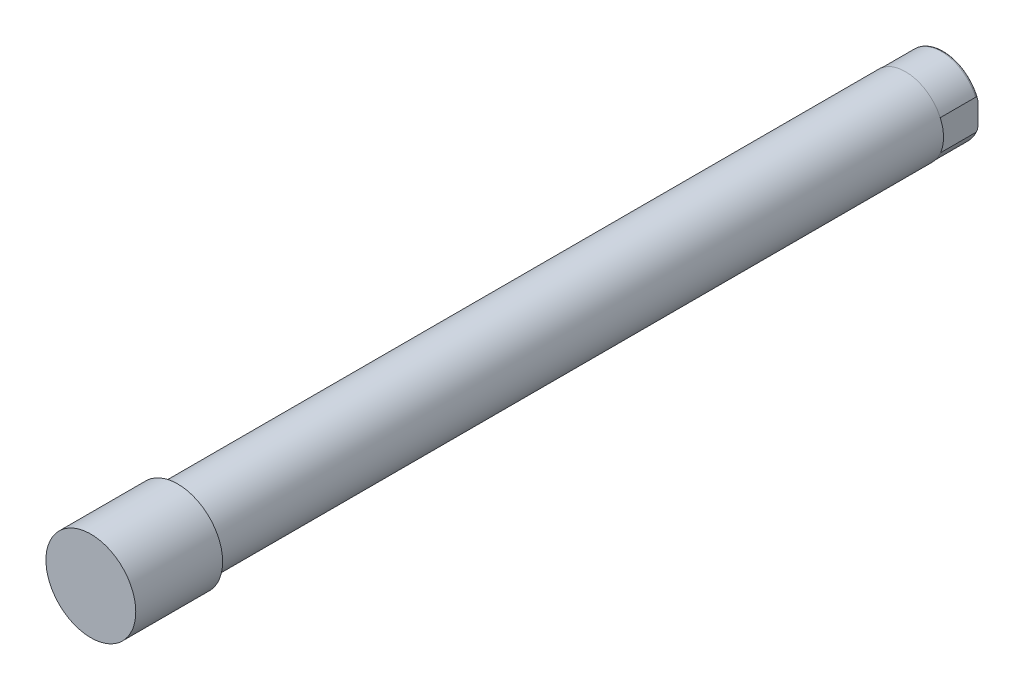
ISO-10303-21;
HEADER;
FILE_DESCRIPTION(('STEP AP214'),'2;1');
FILE_NAME('part.step','',(''),(''),'','','');
FILE_SCHEMA(('AUTOMOTIVE_DESIGN { 1 0 10303 214 1 1 1 1 }'));
ENDSEC;
DATA;
#1=APPLICATION_CONTEXT('core data for automotive mechanical design processes');
#2=APPLICATION_PROTOCOL_DEFINITION('international standard','automotive_design',2000,#1);
#3=PRODUCT_CONTEXT('',#1,'mechanical');
#4=PRODUCT('Part','Part','',(#3));
#5=PRODUCT_RELATED_PRODUCT_CATEGORY('part','',(#4));
#6=PRODUCT_DEFINITION_FORMATION('','',#4);
#7=PRODUCT_DEFINITION_CONTEXT('part definition',#1,'design');
#8=PRODUCT_DEFINITION('design','',#6,#7);
#9=PRODUCT_DEFINITION_SHAPE('','',#8);
#10=(LENGTH_UNIT() NAMED_UNIT(*) SI_UNIT(.MILLI.,.METRE.));
#11=(NAMED_UNIT(*) PLANE_ANGLE_UNIT() SI_UNIT($,.RADIAN.));
#12=(NAMED_UNIT(*) SI_UNIT($,.STERADIAN.) SOLID_ANGLE_UNIT());
#13=UNCERTAINTY_MEASURE_WITH_UNIT(LENGTH_MEASURE(1.E-05),#10,'distance_accuracy_value','');
#14=(GEOMETRIC_REPRESENTATION_CONTEXT(3) GLOBAL_UNCERTAINTY_ASSIGNED_CONTEXT((#13)) GLOBAL_UNIT_ASSIGNED_CONTEXT((#10,
#11,#12)) REPRESENTATION_CONTEXT('',''));
#15=CARTESIAN_POINT('',(0.,0.,0.));
#16=DIRECTION('',(0.,0.,1.));
#17=DIRECTION('',(1.,0.,0.));
#18=AXIS2_PLACEMENT_3D('',#15,#16,#17);
#19=CARTESIAN_POINT('',(0.,0.,255.2069863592));
#20=DIRECTION('',(0.,0.,1.));
#21=DIRECTION('',(-1.,0.,0.));
#22=AXIS2_PLACEMENT_3D('',#19,#20,#21);
#23=PLANE('',#22);
#24=CARTESIAN_POINT('',(0.,0.,255.2069863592));
#25=DIRECTION('',(0.,0.,1.));
#26=DIRECTION('',(0.,-1.,0.));
#27=AXIS2_PLACEMENT_3D('',#24,#25,#26);
#28=CIRCLE('',#27,12.573);
#29=CARTESIAN_POINT('',(0.,-12.573,255.2069863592));
#30=VERTEX_POINT('',#29);
#31=EDGE_CURVE('E10',#30,#30,#28,.T.);
#32=ORIENTED_EDGE('',*,*,#31,.F.);
#33=EDGE_LOOP('',(#32));
#34=FACE_BOUND('',#33,.T.);
#35=CARTESIAN_POINT('',(0.,0.,255.2069863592));
#36=DIRECTION('',(0.,0.,1.));
#37=DIRECTION('',(-1.,0.,0.));
#38=AXIS2_PLACEMENT_3D('',#35,#36,#37);
#39=CIRCLE('',#38,12.69238);
#40=CARTESIAN_POINT('',(-12.69238,0.,255.2069863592));
#41=VERTEX_POINT('',#40);
#42=EDGE_CURVE('E212',#41,#41,#39,.T.);
#43=ORIENTED_EDGE('',*,*,#42,.T.);
#44=EDGE_LOOP('',(#43));
#45=FACE_BOUND('',#44,.T.);
#46=ADVANCED_FACE('F16',(#34,#45),#23,.T.);
#47=CARTESIAN_POINT('',(0.,0.,229.8069863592));
#48=DIRECTION('',(0.,0.,1.));
#49=DIRECTION('',(-1.,0.,0.));
#50=AXIS2_PLACEMENT_3D('',#47,#48,#49);
#51=CYLINDRICAL_SURFACE('',#50,12.69238);
#52=ORIENTED_EDGE('',*,*,#42,.F.);
#53=EDGE_LOOP('',(#52));
#54=FACE_BOUND('',#53,.T.);
#55=CARTESIAN_POINT('',(0.,0.,12.7));
#56=DIRECTION('',(0.,0.,1.));
#57=DIRECTION('',(0.,1.,0.));
#58=AXIS2_PLACEMENT_3D('',#55,#56,#57);
#59=CIRCLE('',#58,12.69238);
#60=CARTESIAN_POINT('',(0.,12.69238,12.7));
#61=VERTEX_POINT('',#60);
#62=EDGE_CURVE('E80',#61,#61,#59,.T.);
#63=ORIENTED_EDGE('',*,*,#62,.T.);
#64=EDGE_LOOP('',(#63));
#65=FACE_BOUND('',#64,.T.);
#66=ADVANCED_FACE('F150',(#54,#65),#51,.T.);
#67=CARTESIAN_POINT('',(0.,0.,16.51));
#68=DIRECTION('',(0.,0.,-1.));
#69=DIRECTION('',(0.,-1.,0.));
#70=AXIS2_PLACEMENT_3D('',#67,#68,#69);
#71=PLANE('',#70);
#72=CARTESIAN_POINT('',(0.,0.,16.51));
#73=DIRECTION('',(0.,0.,-1.));
#74=DIRECTION('',(0.,-1.,0.));
#75=AXIS2_PLACEMENT_3D('',#72,#73,#74);
#76=CIRCLE('',#75,3.375);
#77=CARTESIAN_POINT('',(0.,-3.375,16.51));
#78=VERTEX_POINT('',#77);
#79=EDGE_CURVE('E209',#78,#78,#76,.T.);
#80=ORIENTED_EDGE('',*,*,#79,.T.);
#81=EDGE_LOOP('',(#80));
#82=FACE_BOUND('',#81,.T.);
#83=ADVANCED_FACE('F136',(#82),#71,.T.);
#84=CARTESIAN_POINT('',(0.,0.,-4.72421244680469));
#85=DIRECTION('',(0.,0.,-1.));
#86=DIRECTION('',(0.,-1.,0.));
#87=AXIS2_PLACEMENT_3D('',#84,#85,#86);
#88=CYLINDRICAL_SURFACE('',#87,3.375);
#89=ORIENTED_EDGE('',*,*,#79,.F.);
#90=EDGE_LOOP('',(#89));
#91=FACE_BOUND('',#90,.T.);
#92=CARTESIAN_POINT('',(0.,0.,0.635));
#93=DIRECTION('',(0.,0.,1.));
#94=DIRECTION('',(0.,1.,0.));
#95=AXIS2_PLACEMENT_3D('',#92,#93,#94);
#96=CIRCLE('',#95,3.375);
#97=CARTESIAN_POINT('',(0.,3.37500000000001,0.635000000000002));
#98=VERTEX_POINT('',#97);
#99=EDGE_CURVE('E198',#98,#98,#96,.F.);
#100=ORIENTED_EDGE('',*,*,#99,.T.);
#101=EDGE_LOOP('',(#100));
#102=FACE_BOUND('',#101,.T.);
#103=ADVANCED_FACE('F133',(#91,#102),#88,.F.);
#104=CARTESIAN_POINT('',(0.,0.,0.635));
#105=DIRECTION('',(0.,0.,-1.));
#106=DIRECTION('',(0.,-1.,0.));
#107=AXIS2_PLACEMENT_3D('',#104,#105,#106);
#108=CONICAL_SURFACE('',#107,3.375,0.785398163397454);
#109=CARTESIAN_POINT('',(0.,0.,0.));
#110=DIRECTION('',(0.,0.,1.));
#111=DIRECTION('',(0.,1.,0.));
#112=AXIS2_PLACEMENT_3D('',#109,#110,#111);
#113=CIRCLE('',#112,4.01);
#114=CARTESIAN_POINT('',(0.,4.01000000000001,0.));
#115=VERTEX_POINT('',#114);
#116=EDGE_CURVE('E20',#115,#115,#113,.T.);
#117=ORIENTED_EDGE('',*,*,#116,.F.);
#118=EDGE_LOOP('',(#117));
#119=FACE_BOUND('',#118,.T.);
#120=ORIENTED_EDGE('',*,*,#99,.F.);
#121=EDGE_LOOP('',(#120));
#122=FACE_BOUND('',#121,.T.);
#123=ADVANCED_FACE('F18',(#119,#122),#108,.F.);
#124=CARTESIAN_POINT('',(0.,3.375,0.));
#125=DIRECTION('',(0.,0.,1.));
#126=DIRECTION('',(0.,1.,0.));
#127=AXIS2_PLACEMENT_3D('',#124,#125,#126);
#128=PLANE('',#127);
#129=ORIENTED_EDGE('',*,*,#116,.T.);
#130=EDGE_LOOP('',(#129));
#131=FACE_BOUND('',#130,.T.);
#132=CARTESIAN_POINT('',(0.,0.,0.));
#133=DIRECTION('',(0.,0.,1.));
#134=DIRECTION('',(0.,1.,0.));
#135=AXIS2_PLACEMENT_3D('',#132,#133,#134);
#136=CIRCLE('',#135,11.811);
#137=CARTESIAN_POINT('',(11.4935,-2.72014314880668,0.));
#138=VERTEX_POINT('',#137);
#139=CARTESIAN_POINT('',(-11.4935,-2.72014314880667,0.));
#140=VERTEX_POINT('',#139);
#141=EDGE_CURVE('E104',#138,#140,#136,.F.);
#142=ORIENTED_EDGE('',*,*,#141,.T.);
#143=DIRECTION('',(0.,-1.,0.));
#144=VECTOR('',#143,1.);
#145=CARTESIAN_POINT('',(-11.4935,5.09703705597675,0.));
#146=LINE('',#145,#144);
#147=CARTESIAN_POINT('',(-11.4935,2.72014314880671,0.));
#148=VERTEX_POINT('',#147);
#149=EDGE_CURVE('E94',#148,#140,#146,.T.);
#150=ORIENTED_EDGE('',*,*,#149,.F.);
#151=CARTESIAN_POINT('',(11.4935,2.7201431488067,0.));
#152=VERTEX_POINT('',#151);
#153=EDGE_CURVE('E102',#148,#152,#136,.F.);
#154=ORIENTED_EDGE('',*,*,#153,.T.);
#155=DIRECTION('',(0.,1.,0.));
#156=VECTOR('',#155,1.);
#157=CARTESIAN_POINT('',(11.4935,5.09703705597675,0.));
#158=LINE('',#157,#156);
#159=EDGE_CURVE('E90',#138,#152,#158,.T.);
#160=ORIENTED_EDGE('',*,*,#159,.F.);
#161=EDGE_LOOP('',(#142,#150,#154,#160));
#162=FACE_BOUND('',#161,.T.);
#163=ADVANCED_FACE('F138',(#131,#162),#128,.F.);
#164=CARTESIAN_POINT('',(0.,0.,0.762));
#165=DIRECTION('',(0.,0.,1.));
#166=DIRECTION('',(0.,1.,0.));
#167=AXIS2_PLACEMENT_3D('',#164,#165,#166);
#168=TOROIDAL_SURFACE('',#167,11.811,0.762);
#169=CARTESIAN_POINT('',(-11.4935,0.,0.0692967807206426));
#170=CARTESIAN_POINT('',(-11.4935,-0.126892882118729,0.0692961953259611));
#171=CARTESIAN_POINT('',(-11.4935,-0.253785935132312,0.0683214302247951));
#172=CARTESIAN_POINT('',(-11.4935,-0.507552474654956,0.0645639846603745));
#173=CARTESIAN_POINT('',(-11.4935,-0.634425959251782,0.0617811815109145));
#174=CARTESIAN_POINT('',(-11.4935,-0.888441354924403,0.054807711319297));
#175=CARTESIAN_POINT('',(-11.4935,-1.01558316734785,0.0506136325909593));
#176=CARTESIAN_POINT('',(-11.4935,-1.26981683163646,0.0414520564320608));
#177=CARTESIAN_POINT('',(-11.4935,-1.39690868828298,0.0364846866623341));
#178=CARTESIAN_POINT('',(-11.4935,-1.72923810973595,0.0235085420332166));
#179=CARTESIAN_POINT('',(-11.4935,-1.93447479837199,0.0155077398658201));
#180=CARTESIAN_POINT('',(-11.4935,-2.3452927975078,0.00350629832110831));
#181=CARTESIAN_POINT('',(-11.4935,-2.55087425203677,-0.000490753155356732));
#182=CARTESIAN_POINT('',(-11.4935,-2.8589168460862,0.000314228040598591));
#183=CARTESIAN_POINT('',(-11.4935,-2.96137763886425,0.00170827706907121));
#184=CARTESIAN_POINT('',(-11.4935,-3.16620727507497,0.00754578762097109));
#185=CARTESIAN_POINT('',(-11.4935,-3.26857612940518,0.0119888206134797));
#186=CARTESIAN_POINT('',(-11.4935,-3.47289957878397,0.0248727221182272));
#187=CARTESIAN_POINT('',(-11.4935,-3.57485458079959,0.0333068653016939));
#188=CARTESIAN_POINT('',(-11.4935,-3.77818054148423,0.0554156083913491));
#189=CARTESIAN_POINT('',(-11.4935,-3.87955178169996,0.06908742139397));
#190=CARTESIAN_POINT('',(-11.4935,-4.03106259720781,0.0949374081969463));
#191=CARTESIAN_POINT('',(-11.4935,-4.08165102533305,0.10448729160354));
#192=CARTESIAN_POINT('',(-11.4935,-4.18240597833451,0.125703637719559));
#193=CARTESIAN_POINT('',(-11.4935,-4.23257236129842,0.137370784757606));
#194=CARTESIAN_POINT('',(-11.4935,-4.33209838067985,0.163182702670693));
#195=CARTESIAN_POINT('',(-11.4935,-4.38146010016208,0.177319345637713));
#196=CARTESIAN_POINT('',(-11.4935,-4.47919900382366,0.208628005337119));
#197=CARTESIAN_POINT('',(-11.4935,-4.52757673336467,0.225798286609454));
#198=CARTESIAN_POINT('',(-11.4935,-4.61806962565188,0.262016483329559));
#199=CARTESIAN_POINT('',(-11.4935,-4.66032699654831,0.280704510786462));
#200=CARTESIAN_POINT('',(-11.4935,-4.7431349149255,0.322012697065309));
#201=CARTESIAN_POINT('',(-11.4935,-4.78367806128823,0.344648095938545));
#202=CARTESIAN_POINT('',(-11.4935,-4.86229215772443,0.395289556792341));
#203=CARTESIAN_POINT('',(-11.4935,-4.90031004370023,0.423379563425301));
#204=CARTESIAN_POINT('',(-11.4935,-4.97037880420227,0.486182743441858));
#205=CARTESIAN_POINT('',(-11.4935,-5.00247662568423,0.520838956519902));
#206=CARTESIAN_POINT('',(-11.4935,-5.04022262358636,0.57571309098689));
#207=CARTESIAN_POINT('',(-11.4935,-5.05045795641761,0.592752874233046));
#208=CARTESIAN_POINT('',(-11.4935,-5.06829844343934,0.628176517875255));
#209=CARTESIAN_POINT('',(-11.4935,-5.07590504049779,0.646559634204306));
#210=CARTESIAN_POINT('',(-11.4935,-5.08790591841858,0.684572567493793));
#211=CARTESIAN_POINT('',(-11.4935,-5.09226768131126,0.704212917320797));
#212=CARTESIAN_POINT('',(-11.4935,-5.0971500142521,0.743964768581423));
#213=CARTESIAN_POINT('',(-11.4935,-5.09767385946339,0.764075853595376));
#214=CARTESIAN_POINT('',(-11.4935,-5.09497722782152,0.801901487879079));
#215=CARTESIAN_POINT('',(-11.4935,-5.09214509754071,0.819645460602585));
#216=CARTESIAN_POINT('',(-11.4935,-5.08364214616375,0.854435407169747));
#217=CARTESIAN_POINT('',(-11.4935,-5.07796944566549,0.871480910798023));
#218=CARTESIAN_POINT('',(-11.4935,-5.06176012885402,0.910500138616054));
#219=CARTESIAN_POINT('',(-11.4935,-5.05020880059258,0.932049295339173));
#220=CARTESIAN_POINT('',(-11.4935,-5.02384264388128,0.97304162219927));
#221=CARTESIAN_POINT('',(-11.4935,-5.00902025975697,0.99247975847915));
#222=CARTESIAN_POINT('',(-11.4935,-4.96668214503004,1.04130236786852));
#223=CARTESIAN_POINT('',(-11.4935,-4.93717655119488,1.06894318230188));
#224=CARTESIAN_POINT('',(-11.4935,-4.87453292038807,1.11969282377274));
#225=CARTESIAN_POINT('',(-11.4935,-4.84138518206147,1.14278906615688));
#226=CARTESIAN_POINT('',(-11.4935,-4.77170357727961,1.18607022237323));
#227=CARTESIAN_POINT('',(-11.4935,-4.73509294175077,1.20612961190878));
#228=CARTESIAN_POINT('',(-11.4935,-4.66032044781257,1.24315357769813));
#229=CARTESIAN_POINT('',(-11.4935,-4.62215694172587,1.26011475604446));
#230=CARTESIAN_POINT('',(-11.4935,-4.54474065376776,1.29152031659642));
#231=CARTESIAN_POINT('',(-11.4935,-4.50548604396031,1.30596013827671));
#232=CARTESIAN_POINT('',(-11.4935,-4.42628718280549,1.33270242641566));
#233=CARTESIAN_POINT('',(-11.4935,-4.38634329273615,1.34500597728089));
#234=CARTESIAN_POINT('',(-11.4935,-4.27858567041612,1.37558139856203));
#235=CARTESIAN_POINT('',(-11.4935,-4.2103079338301,1.39221547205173));
#236=CARTESIAN_POINT('',(-11.4935,-4.07289691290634,1.42153442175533));
#237=CARTESIAN_POINT('',(-11.4935,-4.00376315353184,1.43421699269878));
#238=CARTESIAN_POINT('',(-11.4935,-3.86485977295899,1.45641961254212));
#239=CARTESIAN_POINT('',(-11.4935,-3.79508917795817,1.46593347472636));
#240=CARTESIAN_POINT('',(-11.4935,-3.65523676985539,1.48234652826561));
#241=CARTESIAN_POINT('',(-11.4935,-3.58515490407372,1.48924525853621));
#242=CARTESIAN_POINT('',(-11.4935,-3.37385236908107,1.50678626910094));
#243=CARTESIAN_POINT('',(-11.4935,-3.23236218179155,1.51415909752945));
#244=CARTESIAN_POINT('',(-11.4935,-2.94941281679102,1.5229695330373));
#245=CARTESIAN_POINT('',(-11.4935,-2.80795379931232,1.52441412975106));
#246=CARTESIAN_POINT('',(-11.4935,-2.50036989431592,1.52329989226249));
#247=CARTESIAN_POINT('',(-11.4935,-2.33424995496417,1.51999816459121));
#248=CARTESIAN_POINT('',(-11.4935,-2.00208204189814,1.51061234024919));
#249=CARTESIAN_POINT('',(-11.4935,-1.83603408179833,1.50452784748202));
#250=CARTESIAN_POINT('',(-11.4935,-1.50389171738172,1.49176055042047));
#251=CARTESIAN_POINT('',(-11.4935,-1.33779732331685,1.48507749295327));
#252=CARTESIAN_POINT('',(-11.4935,-1.0055718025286,1.47295909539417));
#253=CARTESIAN_POINT('',(-11.4935,-0.839440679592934,1.46752365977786));
#254=CARTESIAN_POINT('',(-11.4935,-0.507781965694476,1.45929152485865));
#255=CARTESIAN_POINT('',(-11.4935,-0.342254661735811,1.45648420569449));
#256=CARTESIAN_POINT('',(-11.4935,-0.0111754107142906,1.45416428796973));
#257=CARTESIAN_POINT('',(-11.4935,0.15437653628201,1.45465168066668));
#258=CARTESIAN_POINT('',(-11.4935,0.485437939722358,1.45880069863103));
#259=CARTESIAN_POINT('',(-11.4935,0.650947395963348,1.46246233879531));
#260=CARTESIAN_POINT('',(-11.4935,0.981900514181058,1.4720536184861));
#261=CARTESIAN_POINT('',(-11.4935,1.14734417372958,1.47798333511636));
#262=CARTESIAN_POINT('',(-11.4935,1.47852523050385,1.49061349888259));
#263=CARTESIAN_POINT('',(-11.4935,1.64426256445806,1.49731544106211));
#264=CARTESIAN_POINT('',(-11.4935,1.9758076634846,1.50954880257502));
#265=CARTESIAN_POINT('',(-11.4935,2.14161543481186,1.51508007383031));
#266=CARTESIAN_POINT('',(-11.4935,2.47341239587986,1.52268768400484));
#267=CARTESIAN_POINT('',(-11.4935,2.63940163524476,1.52476213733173));
#268=CARTESIAN_POINT('',(-11.4935,2.97133248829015,1.52271711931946));
#269=CARTESIAN_POINT('',(-11.4935,3.1372740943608,1.5186001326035));
#270=CARTESIAN_POINT('',(-11.4935,3.38613550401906,1.50500966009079));
#271=CARTESIAN_POINT('',(-11.4935,3.46925125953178,1.49922413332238));
#272=CARTESIAN_POINT('',(-11.4935,3.63523838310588,1.48452631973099));
#273=CARTESIAN_POINT('',(-11.4935,3.7181096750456,1.47561314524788));
#274=CARTESIAN_POINT('',(-11.4935,3.8834005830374,1.45385768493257));
#275=CARTESIAN_POINT('',(-11.4935,3.96581991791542,1.44101318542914));
#276=CARTESIAN_POINT('',(-11.4935,4.12967782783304,1.41030415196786));
#277=CARTESIAN_POINT('',(-11.4935,4.21111702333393,1.39244298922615));
#278=CARTESIAN_POINT('',(-11.4935,4.37277499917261,1.34998542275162));
#279=CARTESIAN_POINT('',(-11.4935,4.45298529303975,1.32535467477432));
#280=CARTESIAN_POINT('',(-11.4935,4.57055485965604,1.28144845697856));
#281=CARTESIAN_POINT('',(-11.4935,4.60922233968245,1.26568638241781));
#282=CARTESIAN_POINT('',(-11.4935,4.68526518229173,1.23132879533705));
#283=CARTESIAN_POINT('',(-11.4935,4.72264164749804,1.21273577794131));
#284=CARTESIAN_POINT('',(-11.4935,4.78740678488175,1.17653326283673));
#285=CARTESIAN_POINT('',(-11.4935,4.81517799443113,1.15961369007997));
#286=CARTESIAN_POINT('',(-11.4935,4.86906850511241,1.12317332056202));
#287=CARTESIAN_POINT('',(-11.4935,4.89518458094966,1.10364766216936));
#288=CARTESIAN_POINT('',(-11.4935,4.9451367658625,1.06126433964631));
#289=CARTESIAN_POINT('',(-11.4935,4.96894270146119,1.03837044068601));
#290=CARTESIAN_POINT('',(-11.4935,5.0123735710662,0.98890211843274));
#291=CARTESIAN_POINT('',(-11.4935,5.03201460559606,0.962342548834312));
#292=CARTESIAN_POINT('',(-11.4935,5.05799898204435,0.917209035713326));
#293=CARTESIAN_POINT('',(-11.4935,5.06648257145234,0.899874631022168));
#294=CARTESIAN_POINT('',(-11.4935,5.08061154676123,0.864078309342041));
#295=CARTESIAN_POINT('',(-11.4935,5.08625993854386,0.845617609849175));
#296=CARTESIAN_POINT('',(-11.4935,5.0942227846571,0.807821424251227));
#297=CARTESIAN_POINT('',(-11.4935,5.09651080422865,0.7884802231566));
#298=CARTESIAN_POINT('',(-11.4935,5.09740028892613,0.749712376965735));
#299=CARTESIAN_POINT('',(-11.4935,5.09600235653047,0.730285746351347));
#300=CARTESIAN_POINT('',(-11.4935,5.08998844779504,0.693828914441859));
#301=CARTESIAN_POINT('',(-11.4935,5.08568671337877,0.676744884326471));
#302=CARTESIAN_POINT('',(-11.4935,5.07456544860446,0.643425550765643));
#303=CARTESIAN_POINT('',(-11.4935,5.06774459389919,0.627190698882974));
#304=CARTESIAN_POINT('',(-11.4935,5.04798792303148,0.587684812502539));
#305=CARTESIAN_POINT('',(-11.4935,5.03371113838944,0.565087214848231));
#306=CARTESIAN_POINT('',(-11.4935,5.001817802,0.522390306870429));
#307=CARTESIAN_POINT('',(-11.4935,4.98419202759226,0.502298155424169));
#308=CARTESIAN_POINT('',(-11.4935,4.9329313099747,0.450539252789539));
#309=CARTESIAN_POINT('',(-11.4935,4.8970159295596,0.421154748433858));
#310=CARTESIAN_POINT('',(-11.4935,4.82146615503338,0.367730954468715));
#311=CARTESIAN_POINT('',(-11.4935,4.78182217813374,0.343706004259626));
#312=CARTESIAN_POINT('',(-11.4935,4.6870231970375,0.292631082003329));
#313=CARTESIAN_POINT('',(-11.4935,4.63103054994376,0.267155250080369));
#314=CARTESIAN_POINT('',(-11.4935,4.51686717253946,0.22156158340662));
#315=CARTESIAN_POINT('',(-11.4935,4.45869243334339,0.201454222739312));
#316=CARTESIAN_POINT('',(-11.4935,4.34081668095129,0.165335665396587));
#317=CARTESIAN_POINT('',(-11.4935,4.28110995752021,0.149343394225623));
#318=CARTESIAN_POINT('',(-11.4935,4.16097255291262,0.120738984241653));
#319=CARTESIAN_POINT('',(-11.4935,4.10054263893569,0.108123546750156));
#320=CARTESIAN_POINT('',(-11.4935,3.93100446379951,0.0766853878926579));
#321=CARTESIAN_POINT('',(-11.4935,3.82133858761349,0.0608860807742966));
#322=CARTESIAN_POINT('',(-11.4935,3.60125990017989,0.0356140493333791));
#323=CARTESIAN_POINT('',(-11.4935,3.49084661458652,0.0261458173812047));
#324=CARTESIAN_POINT('',(-11.4935,3.26947072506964,0.0119151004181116));
#325=CARTESIAN_POINT('',(-11.4935,3.15850743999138,0.00716372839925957));
#326=CARTESIAN_POINT('',(-11.4935,2.93647933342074,0.00118653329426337));
#327=CARTESIAN_POINT('',(-11.4935,2.82541449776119,-3.8684055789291E-05));
#328=CARTESIAN_POINT('',(-11.4935,2.49181052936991,8.10114788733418E-05));
#329=CARTESIAN_POINT('',(-11.4935,2.26928570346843,0.00524044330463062));
#330=CARTESIAN_POINT('',(-11.4935,1.82468104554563,0.0194616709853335));
#331=CARTESIAN_POINT('',(-11.4935,1.60260100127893,0.028518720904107));
#332=CARTESIAN_POINT('',(-11.4935,1.26539134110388,0.0415572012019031));
#333=CARTESIAN_POINT('',(-11.4935,1.15027844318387,0.0458818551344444));
#334=CARTESIAN_POINT('',(-11.4935,0.920000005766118,0.0537394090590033));
#335=CARTESIAN_POINT('',(-11.4935,0.804834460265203,0.0572721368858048));
#336=CARTESIAN_POINT('',(-11.4935,0.574734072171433,0.0631011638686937));
#337=CARTESIAN_POINT('',(-11.4935,0.459799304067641,0.0654002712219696));
#338=CARTESIAN_POINT('',(-11.4935,0.22990973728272,0.0684983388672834));
#339=CARTESIAN_POINT('',(-11.4935,0.114954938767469,0.0692973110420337));
#340=CARTESIAN_POINT('',(-11.4935,0.,0.0692967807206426));
#341=B_SPLINE_CURVE_WITH_KNOTS('',3,(#169,#170,#171,#172,#173,#174,#175,#176,#177,#178,#179,
#180,#181,#182,#183,#184,#185,#186,#187,#188,#189,#190,#191,#192,#193,#194,#195,#196,#197,#198,
#199,#200,#201,#202,#203,#204,#205,#206,#207,#208,#209,#210,#211,#212,#213,#214,#215,#216,#217,
#218,#219,#220,#221,#222,#223,#224,#225,#226,#227,#228,#229,#230,#231,#232,#233,#234,#235,#236,
#237,#238,#239,#240,#241,#242,#243,#244,#245,#246,#247,#248,#249,#250,#251,#252,#253,#254,#255,
#256,#257,#258,#259,#260,#261,#262,#263,#264,#265,#266,#267,#268,#269,#270,#271,#272,#273,#274,
#275,#276,#277,#278,#279,#280,#281,#282,#283,#284,#285,#286,#287,#288,#289,#290,#291,#292,#293,
#294,#295,#296,#297,#298,#299,#300,#301,#302,#303,#304,#305,#306,#307,#308,#309,#310,#311,#312,
#313,#314,#315,#316,#317,#318,#319,#320,#321,#322,#323,#324,#325,#326,#327,#328,#329,#330,#331,
#332,#333,#334,#335,#336,#337,#338,#339,#340),.UNSPECIFIED.,.T.,.F.,(4,2,2,2,2,2,2,2,2,2,2,2,2,
2,2,2,2,2,2,2,2,2,2,2,2,2,2,2,2,2,2,2,2,2,2,2,2,2,2,2,2,2,2,2,2,2,2,2,2,2,2,2,2,2,2,2,2,2,2,2,2,
2,2,2,2,2,2,2,2,2,2,2,2,2,2,2,2,2,2,2,2,2,2,2,2,4),(0.,0.380675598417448,0.761377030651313,
1.14300548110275,1.5245709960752,2.14075619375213,2.75749308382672,3.06487070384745,
3.37220513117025,3.67902351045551,3.98567886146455,4.14008965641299,4.29455044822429,
4.44851212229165,4.60238600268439,4.74086028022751,4.87988152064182,5.02124151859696,
5.16142717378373,5.22088517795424,5.28031049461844,5.34032360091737,5.4002854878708,
5.45393540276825,5.5076208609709,5.58055703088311,5.65366346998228,5.77427079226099,
5.89520753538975,6.02025180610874,6.14543240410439,6.2708371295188,6.39617801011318,
6.60683320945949,6.81761107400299,7.02879808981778,7.24002232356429,7.66485310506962,
8.08918284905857,8.58758698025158,9.08606207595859,9.58474901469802,10.0833977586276,
10.5800227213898,11.0766463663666,11.5732723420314,12.0699152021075,12.5675362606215,
13.0652202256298,13.563175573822,14.060931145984,14.3108363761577,14.5608125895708,
14.8109298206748,15.0608793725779,15.3121211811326,15.4373083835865,15.562385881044,
15.6598354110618,15.7574693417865,15.8562429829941,15.9546275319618,16.0123273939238,
16.0699659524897,16.1280555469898,16.1861356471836,16.2387663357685,16.2914247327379,
16.3711541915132,16.4511064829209,16.5895345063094,16.7283285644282,16.9124465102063,
17.0969210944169,17.2822295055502,17.4673562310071,17.7994571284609,18.1317934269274,
18.4649108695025,18.7980855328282,19.4657059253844,20.1325156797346,20.4780956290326,
20.8237506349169,21.1686154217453,21.5134774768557),.UNSPECIFIED.);
#342=CARTESIAN_POINT('',(-11.4935,5.09703705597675,0.762000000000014));
#343=VERTEX_POINT('',#342);
#344=EDGE_CURVE('E117',#343,#148,#341,.T.);
#345=ORIENTED_EDGE('',*,*,#344,.F.);
#346=CARTESIAN_POINT('',(0.,0.,0.762));
#347=DIRECTION('',(0.,0.,1.));
#348=DIRECTION('',(0.,1.,0.));
#349=AXIS2_PLACEMENT_3D('',#346,#347,#348);
#350=CIRCLE('',#349,12.573);
#351=CARTESIAN_POINT('',(11.4935,5.09703705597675,0.761999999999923));
#352=VERTEX_POINT('',#351);
#353=EDGE_CURVE('E107',#352,#343,#350,.T.);
#354=ORIENTED_EDGE('',*,*,#353,.F.);
#355=CARTESIAN_POINT('',(11.4935,0.,0.0692967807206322));
#356=CARTESIAN_POINT('',(11.4935,0.126892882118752,0.0692961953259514));
#357=CARTESIAN_POINT('',(11.4935,0.253785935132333,0.0683214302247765));
#358=CARTESIAN_POINT('',(11.4935,0.507552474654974,0.0645639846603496));
#359=CARTESIAN_POINT('',(11.4935,0.634425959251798,0.0617811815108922));
#360=CARTESIAN_POINT('',(11.4935,0.888441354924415,0.0548077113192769));
#361=CARTESIAN_POINT('',(11.4935,1.01558316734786,0.0506136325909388));
#362=CARTESIAN_POINT('',(11.4935,1.26981683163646,0.0414520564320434));
#363=CARTESIAN_POINT('',(11.4935,1.39690868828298,0.0364846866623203));
#364=CARTESIAN_POINT('',(11.4935,1.72923810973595,0.0235085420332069));
#365=CARTESIAN_POINT('',(11.4935,1.93447479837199,0.0155077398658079));
#366=CARTESIAN_POINT('',(11.4935,2.34529279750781,0.00350629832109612));
#367=CARTESIAN_POINT('',(11.4935,2.55087425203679,-0.000490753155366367));
#368=CARTESIAN_POINT('',(11.4935,2.85891684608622,0.000314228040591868));
#369=CARTESIAN_POINT('',(11.4935,2.96137763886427,0.00170827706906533));
#370=CARTESIAN_POINT('',(11.4935,3.166207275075,0.00754578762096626));
#371=CARTESIAN_POINT('',(11.4935,3.26857612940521,0.0119888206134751));
#372=CARTESIAN_POINT('',(11.4935,3.47289957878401,0.0248727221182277));
#373=CARTESIAN_POINT('',(11.4935,3.57485458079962,0.0333068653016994));
#374=CARTESIAN_POINT('',(11.4935,3.77818054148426,0.0554156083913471));
#375=CARTESIAN_POINT('',(11.4935,3.87955178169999,0.0690874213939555));
#376=CARTESIAN_POINT('',(11.4935,4.03106259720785,0.0949374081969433));
#377=CARTESIAN_POINT('',(11.4935,4.08165102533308,0.104487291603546));
#378=CARTESIAN_POINT('',(11.4935,4.18240597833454,0.125703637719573));
#379=CARTESIAN_POINT('',(11.4935,4.23257236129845,0.137370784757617));
#380=CARTESIAN_POINT('',(11.4935,4.33209838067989,0.16318270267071));
#381=CARTESIAN_POINT('',(11.4935,4.38146010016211,0.177319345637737));
#382=CARTESIAN_POINT('',(11.4935,4.4791990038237,0.208628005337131));
#383=CARTESIAN_POINT('',(11.4935,4.52757673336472,0.225798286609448));
#384=CARTESIAN_POINT('',(11.4935,4.61806962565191,0.26201648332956));
#385=CARTESIAN_POINT('',(11.4935,4.66032699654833,0.280704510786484));
#386=CARTESIAN_POINT('',(11.4935,4.74313491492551,0.322012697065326));
#387=CARTESIAN_POINT('',(11.4935,4.78367806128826,0.344648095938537));
#388=CARTESIAN_POINT('',(11.4935,4.86229215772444,0.395289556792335));
#389=CARTESIAN_POINT('',(11.4935,4.90031004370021,0.423379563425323));
#390=CARTESIAN_POINT('',(11.4935,4.97037880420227,0.486182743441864));
#391=CARTESIAN_POINT('',(11.4935,5.00247662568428,0.520838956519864));
#392=CARTESIAN_POINT('',(11.4935,5.04022262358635,0.575713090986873));
#393=CARTESIAN_POINT('',(11.4935,5.05045795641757,0.592752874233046));
#394=CARTESIAN_POINT('',(11.4935,5.06829844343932,0.628176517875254));
#395=CARTESIAN_POINT('',(11.4935,5.07590504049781,0.646559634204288));
#396=CARTESIAN_POINT('',(11.4935,5.0879059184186,0.684572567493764));
#397=CARTESIAN_POINT('',(11.4935,5.09226768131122,0.704212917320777));
#398=CARTESIAN_POINT('',(11.4935,5.09715001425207,0.743964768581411));
#399=CARTESIAN_POINT('',(11.4935,5.09767385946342,0.764075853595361));
#400=CARTESIAN_POINT('',(11.4935,5.09497722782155,0.801901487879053));
#401=CARTESIAN_POINT('',(11.4935,5.09214509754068,0.819645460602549));
#402=CARTESIAN_POINT('',(11.4935,5.08364214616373,0.854435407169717));
#403=CARTESIAN_POINT('',(11.4935,5.07796944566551,0.871480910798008));
#404=CARTESIAN_POINT('',(11.4935,5.06176012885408,0.910500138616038));
#405=CARTESIAN_POINT('',(11.4935,5.05020880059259,0.932049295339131));
#406=CARTESIAN_POINT('',(11.4935,5.02384264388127,0.973041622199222));
#407=CARTESIAN_POINT('',(11.4935,5.009020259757,0.992479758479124));
#408=CARTESIAN_POINT('',(11.4935,4.96668214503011,1.04130236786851));
#409=CARTESIAN_POINT('',(11.4935,4.93717655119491,1.06894318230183));
#410=CARTESIAN_POINT('',(11.4935,4.87453292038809,1.11969282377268));
#411=CARTESIAN_POINT('',(11.4935,4.84138518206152,1.14278906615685));
#412=CARTESIAN_POINT('',(11.4935,4.77170357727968,1.18607022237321));
#413=CARTESIAN_POINT('',(11.4935,4.73509294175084,1.20612961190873));
#414=CARTESIAN_POINT('',(11.4935,4.66032044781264,1.24315357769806));
#415=CARTESIAN_POINT('',(11.4935,4.62215694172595,1.2601147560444));
#416=CARTESIAN_POINT('',(11.4935,4.54474065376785,1.29152031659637));
#417=CARTESIAN_POINT('',(11.4935,4.5054860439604,1.30596013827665));
#418=CARTESIAN_POINT('',(11.4935,4.42628718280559,1.33270242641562));
#419=CARTESIAN_POINT('',(11.4935,4.38634329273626,1.34500597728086));
#420=CARTESIAN_POINT('',(11.4935,4.27858567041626,1.375581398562));
#421=CARTESIAN_POINT('',(11.4935,4.21030793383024,1.39221547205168));
#422=CARTESIAN_POINT('',(11.4935,4.07289691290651,1.42153442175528));
#423=CARTESIAN_POINT('',(11.4935,4.00376315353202,1.43421699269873));
#424=CARTESIAN_POINT('',(11.4935,3.86485977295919,1.45641961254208));
#425=CARTESIAN_POINT('',(11.4935,3.79508917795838,1.46593347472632));
#426=CARTESIAN_POINT('',(11.4935,3.65523676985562,1.48234652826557));
#427=CARTESIAN_POINT('',(11.4935,3.58515490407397,1.48924525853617));
#428=CARTESIAN_POINT('',(11.4935,3.37385236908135,1.50678626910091));
#429=CARTESIAN_POINT('',(11.4935,3.23236218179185,1.51415909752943));
#430=CARTESIAN_POINT('',(11.4935,2.94941281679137,1.52296953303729));
#431=CARTESIAN_POINT('',(11.4935,2.80795379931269,1.52441412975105));
#432=CARTESIAN_POINT('',(11.4935,2.50036989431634,1.52329989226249));
#433=CARTESIAN_POINT('',(11.4935,2.33424995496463,1.51999816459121));
#434=CARTESIAN_POINT('',(11.4935,2.00208204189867,1.5106123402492));
#435=CARTESIAN_POINT('',(11.4935,1.8360340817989,1.50452784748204));
#436=CARTESIAN_POINT('',(11.4935,1.50389171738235,1.49176055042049));
#437=CARTESIAN_POINT('',(11.4935,1.33779732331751,1.48507749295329));
#438=CARTESIAN_POINT('',(11.4935,1.00557180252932,1.47295909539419));
#439=CARTESIAN_POINT('',(11.4935,0.83944067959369,1.46752365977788));
#440=CARTESIAN_POINT('',(11.4935,0.507781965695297,1.45929152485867));
#441=CARTESIAN_POINT('',(11.4935,0.342254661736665,1.4564842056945));
#442=CARTESIAN_POINT('',(11.4935,0.01117541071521,1.45416428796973));
#443=CARTESIAN_POINT('',(11.4935,-0.154376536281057,1.45465168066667));
#444=CARTESIAN_POINT('',(11.4935,-0.485437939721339,1.45880069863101));
#445=CARTESIAN_POINT('',(11.4935,-0.650947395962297,1.46246233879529));
#446=CARTESIAN_POINT('',(11.4935,-0.981900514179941,1.47205361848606));
#447=CARTESIAN_POINT('',(11.4935,-1.14734417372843,1.47798333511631));
#448=CARTESIAN_POINT('',(11.4935,-1.47852523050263,1.49061349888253));
#449=CARTESIAN_POINT('',(11.4935,-1.64426256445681,1.49731544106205));
#450=CARTESIAN_POINT('',(11.4935,-1.97580766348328,1.50954880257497));
#451=CARTESIAN_POINT('',(11.4935,-2.1416154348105,1.51508007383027));
#452=CARTESIAN_POINT('',(11.4935,-2.47341239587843,1.5226876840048));
#453=CARTESIAN_POINT('',(11.4935,-2.63940163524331,1.5247621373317));
#454=CARTESIAN_POINT('',(11.4935,-2.97133248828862,1.52271711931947));
#455=CARTESIAN_POINT('',(11.4935,-3.13727409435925,1.51860013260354));
#456=CARTESIAN_POINT('',(11.4935,-3.38613550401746,1.50500966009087));
#457=CARTESIAN_POINT('',(11.4935,-3.46925125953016,1.49922413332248));
#458=CARTESIAN_POINT('',(11.4935,-3.63523838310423,1.48452631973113));
#459=CARTESIAN_POINT('',(11.4935,-3.71810967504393,1.47561314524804));
#460=CARTESIAN_POINT('',(11.4935,-3.8834005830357,1.45385768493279));
#461=CARTESIAN_POINT('',(11.4935,-3.96581991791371,1.44101318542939));
#462=CARTESIAN_POINT('',(11.4935,-4.1296778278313,1.41030415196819));
#463=CARTESIAN_POINT('',(11.4935,-4.21111702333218,1.39244298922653));
#464=CARTESIAN_POINT('',(11.4935,-4.37277499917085,1.34998542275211));
#465=CARTESIAN_POINT('',(11.4935,-4.45298529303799,1.32535467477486));
#466=CARTESIAN_POINT('',(11.4935,-4.57055485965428,1.2814484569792));
#467=CARTESIAN_POINT('',(11.4935,-4.60922233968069,1.26568638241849));
#468=CARTESIAN_POINT('',(11.4935,-4.68526518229,1.23132879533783));
#469=CARTESIAN_POINT('',(11.4935,-4.72264164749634,1.21273577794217));
#470=CARTESIAN_POINT('',(11.4935,-4.78740678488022,1.17653326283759));
#471=CARTESIAN_POINT('',(11.4935,-4.81517799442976,1.15961369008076));
#472=CARTESIAN_POINT('',(11.4935,-4.86906850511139,1.12317332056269));
#473=CARTESIAN_POINT('',(11.4935,-4.89518458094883,1.10364766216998));
#474=CARTESIAN_POINT('',(11.4935,-4.94513676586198,1.06126433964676));
#475=CARTESIAN_POINT('',(11.4935,-4.96894270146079,1.03837044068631));
#476=CARTESIAN_POINT('',(11.4935,-5.01237357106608,0.988902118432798));
#477=CARTESIAN_POINT('',(11.4935,-5.0320146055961,0.962342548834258));
#478=CARTESIAN_POINT('',(11.4935,-5.05799898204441,0.917209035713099));
#479=CARTESIAN_POINT('',(11.4935,-5.06648257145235,0.899874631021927));
#480=CARTESIAN_POINT('',(11.4935,-5.08061154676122,0.864078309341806));
#481=CARTESIAN_POINT('',(11.4935,-5.08625993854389,0.845617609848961));
#482=CARTESIAN_POINT('',(11.4935,-5.09422278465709,0.807821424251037));
#483=CARTESIAN_POINT('',(11.4935,-5.09651080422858,0.788480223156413));
#484=CARTESIAN_POINT('',(11.4935,-5.09740028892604,0.74971237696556));
#485=CARTESIAN_POINT('',(11.4935,-5.09600235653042,0.730285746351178));
#486=CARTESIAN_POINT('',(11.4935,-5.08998844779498,0.693828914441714));
#487=CARTESIAN_POINT('',(11.4935,-5.08568671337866,0.676744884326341));
#488=CARTESIAN_POINT('',(11.4935,-5.07456544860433,0.643425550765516));
#489=CARTESIAN_POINT('',(11.4935,-5.06774459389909,0.627190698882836));
#490=CARTESIAN_POINT('',(11.4935,-5.04798792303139,0.587684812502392));
#491=CARTESIAN_POINT('',(11.4935,-5.0337111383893,0.565087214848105));
#492=CARTESIAN_POINT('',(11.4935,-5.0018178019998,0.522390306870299));
#493=CARTESIAN_POINT('',(11.4935,-4.98419202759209,0.502298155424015));
#494=CARTESIAN_POINT('',(11.4935,-4.9329313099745,0.450539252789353));
#495=CARTESIAN_POINT('',(11.4935,-4.89701592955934,0.421154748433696));
#496=CARTESIAN_POINT('',(11.4935,-4.82146615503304,0.367730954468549));
#497=CARTESIAN_POINT('',(11.4935,-4.78182217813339,0.343706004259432));
#498=CARTESIAN_POINT('',(11.4935,-4.68702319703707,0.292631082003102));
#499=CARTESIAN_POINT('',(11.4935,-4.63103054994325,0.267155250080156));
#500=CARTESIAN_POINT('',(11.4935,-4.51686717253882,0.22156158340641));
#501=CARTESIAN_POINT('',(11.4935,-4.45869243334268,0.201454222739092));
#502=CARTESIAN_POINT('',(11.4935,-4.34081668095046,0.16533566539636));
#503=CARTESIAN_POINT('',(11.4935,-4.28110995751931,0.149343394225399));
#504=CARTESIAN_POINT('',(11.4935,-4.16097255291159,0.12073898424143));
#505=CARTESIAN_POINT('',(11.4935,-4.1005426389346,0.108123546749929));
#506=CARTESIAN_POINT('',(11.4935,-3.93100446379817,0.0766853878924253));
#507=CARTESIAN_POINT('',(11.4935,-3.82133858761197,0.0608860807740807));
#508=CARTESIAN_POINT('',(11.4935,-3.60125990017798,0.0356140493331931));
#509=CARTESIAN_POINT('',(11.4935,-3.49084661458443,0.0261458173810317));
#510=CARTESIAN_POINT('',(11.4935,-3.26947072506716,0.0119151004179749));
#511=CARTESIAN_POINT('',(11.4935,-3.15850743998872,0.00716372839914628));
#512=CARTESIAN_POINT('',(11.4935,-2.9364793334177,0.0011865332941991));
#513=CARTESIAN_POINT('',(11.4935,-2.82541449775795,-3.86840558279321E-05));
#514=CARTESIAN_POINT('',(11.4935,-2.49181052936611,8.10114789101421E-05));
#515=CARTESIAN_POINT('',(11.4935,-2.26928570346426,0.00524044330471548));
#516=CARTESIAN_POINT('',(11.4935,-1.82468104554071,0.019461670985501));
#517=CARTESIAN_POINT('',(11.4935,-1.60260100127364,0.0285187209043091));
#518=CARTESIAN_POINT('',(11.4935,-1.26539134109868,0.0415572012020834));
#519=CARTESIAN_POINT('',(11.4935,-1.15027844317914,0.0458818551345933));
#520=CARTESIAN_POINT('',(11.4935,-0.920000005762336,0.053739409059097));
#521=CARTESIAN_POINT('',(11.4935,-0.804834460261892,0.0572721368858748));
#522=CARTESIAN_POINT('',(11.4935,-0.574734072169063,0.0631011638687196));
#523=CARTESIAN_POINT('',(11.4935,-0.459799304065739,0.065400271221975));
#524=CARTESIAN_POINT('',(11.4935,-0.229909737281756,0.0684983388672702));
#525=CARTESIAN_POINT('',(11.4935,-0.114954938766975,0.0692973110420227));
#526=CARTESIAN_POINT('',(11.4935,0.,0.0692967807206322));
#527=B_SPLINE_CURVE_WITH_KNOTS('',3,(#355,#356,#357,#358,#359,#360,#361,#362,#363,#364,#365,
#366,#367,#368,#369,#370,#371,#372,#373,#374,#375,#376,#377,#378,#379,#380,#381,#382,#383,#384,
#385,#386,#387,#388,#389,#390,#391,#392,#393,#394,#395,#396,#397,#398,#399,#400,#401,#402,#403,
#404,#405,#406,#407,#408,#409,#410,#411,#412,#413,#414,#415,#416,#417,#418,#419,#420,#421,#422,
#423,#424,#425,#426,#427,#428,#429,#430,#431,#432,#433,#434,#435,#436,#437,#438,#439,#440,#441,
#442,#443,#444,#445,#446,#447,#448,#449,#450,#451,#452,#453,#454,#455,#456,#457,#458,#459,#460,
#461,#462,#463,#464,#465,#466,#467,#468,#469,#470,#471,#472,#473,#474,#475,#476,#477,#478,#479,
#480,#481,#482,#483,#484,#485,#486,#487,#488,#489,#490,#491,#492,#493,#494,#495,#496,#497,#498,
#499,#500,#501,#502,#503,#504,#505,#506,#507,#508,#509,#510,#511,#512,#513,#514,#515,#516,#517,
#518,#519,#520,#521,#522,#523,#524,#525,#526),.UNSPECIFIED.,.T.,.F.,(4,2,2,2,2,2,2,2,2,2,2,2,2,
2,2,2,2,2,2,2,2,2,2,2,2,2,2,2,2,2,2,2,2,2,2,2,2,2,2,2,2,2,2,2,2,2,2,2,2,2,2,2,2,2,2,2,2,2,2,2,2,
2,2,2,2,2,2,2,2,2,2,2,2,2,2,2,2,2,2,2,2,2,2,2,2,4),(0.,0.380675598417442,0.761377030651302,
1.14300548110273,1.52457099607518,2.14075619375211,2.75749308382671,3.06487070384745,
3.37220513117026,3.67902351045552,3.98567886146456,4.140089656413,4.2945504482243,
4.44851212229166,4.6023860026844,4.74086028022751,4.87988152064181,5.02124151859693,
5.16142717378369,5.2208851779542,5.2803104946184,5.34032360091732,5.40028548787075,
5.4539354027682,5.50762086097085,5.58055703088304,5.65366346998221,5.77427079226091,
5.89520753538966,6.02025180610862,6.14543240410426,6.27083712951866,6.39617801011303,
6.6068332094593,6.81761107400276,7.02879808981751,7.24002232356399,7.66485310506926,
8.08918284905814,8.58758698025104,9.08606207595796,9.58474901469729,10.0833977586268,
10.5800227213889,11.0766463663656,11.5732723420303,12.0699152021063,12.5675362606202,
13.0652202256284,13.5631755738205,14.0609311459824,14.3108363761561,14.5608125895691,
14.810929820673,15.060879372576,15.3121211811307,15.4373083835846,15.562385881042,
15.6598354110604,15.7574693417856,15.8562429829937,15.954627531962,16.0123273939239,
16.0699659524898,16.1280555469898,16.1861356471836,16.2387663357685,16.2914247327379,
16.3711541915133,16.451106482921,16.5895345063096,16.7283285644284,16.9124465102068,
17.0969210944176,17.282229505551,17.4673562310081,17.7994571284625,18.1317934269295,
18.4649108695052,18.7980855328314,19.4657059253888,20.1325156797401,20.4780956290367,
20.8237506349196,21.1686154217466,21.5134774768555),.UNSPECIFIED.);
#528=EDGE_CURVE('E116',#152,#352,#527,.T.);
#529=ORIENTED_EDGE('',*,*,#528,.F.);
#530=ORIENTED_EDGE('',*,*,#153,.F.);
#531=EDGE_LOOP('',(#345,#354,#529,#530));
#532=FACE_BOUND('',#531,.T.);
#533=ADVANCED_FACE('F122',(#532),#168,.T.);
#534=CARTESIAN_POINT('',(-11.4935,-5.09703705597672,0.761999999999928));
#535=VERTEX_POINT('',#534);
#536=EDGE_CURVE('E89',#140,#535,#341,.T.);
#537=ORIENTED_EDGE('',*,*,#536,.F.);
#538=ORIENTED_EDGE('',*,*,#141,.F.);
#539=CARTESIAN_POINT('',(11.4935,-5.09703705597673,0.762));
#540=VERTEX_POINT('',#539);
#541=EDGE_CURVE('E110',#540,#138,#527,.T.);
#542=ORIENTED_EDGE('',*,*,#541,.F.);
#543=EDGE_CURVE('E65',#535,#540,#350,.T.);
#544=ORIENTED_EDGE('',*,*,#543,.F.);
#545=EDGE_LOOP('',(#537,#538,#542,#544));
#546=FACE_BOUND('',#545,.T.);
#547=ADVANCED_FACE('F143',(#546),#168,.T.);
#548=CARTESIAN_POINT('',(-11.4935,5.09703705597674,12.7));
#549=DIRECTION('',(1.,0.,0.));
#550=DIRECTION('',(0.,0.,-1.));
#551=AXIS2_PLACEMENT_3D('',#548,#549,#550);
#552=PLANE('',#551);
#553=ORIENTED_EDGE('',*,*,#536,.T.);
#554=DIRECTION('',(0.,0.,-1.));
#555=VECTOR('',#554,1.);
#556=CARTESIAN_POINT('',(-11.4935,-5.09703705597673,12.7));
#557=LINE('',#556,#555);
#558=CARTESIAN_POINT('',(-11.4935,-5.09703705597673,12.7));
#559=VERTEX_POINT('',#558);
#560=EDGE_CURVE('E83',#559,#535,#557,.T.);
#561=ORIENTED_EDGE('',*,*,#560,.F.);
#562=DIRECTION('',(0.,-1.,0.));
#563=VECTOR('',#562,1.);
#564=CARTESIAN_POINT('',(-11.4935,0.,12.7));
#565=LINE('',#564,#563);
#566=CARTESIAN_POINT('',(-11.4935,5.09703705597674,12.7));
#567=VERTEX_POINT('',#566);
#568=EDGE_CURVE('E77',#567,#559,#565,.T.);
#569=ORIENTED_EDGE('',*,*,#568,.F.);
#570=DIRECTION('',(0.,0.,-1.));
#571=VECTOR('',#570,1.);
#572=CARTESIAN_POINT('',(-11.4935,5.09703705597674,12.7));
#573=LINE('',#572,#571);
#574=EDGE_CURVE('E72',#567,#343,#573,.T.);
#575=ORIENTED_EDGE('',*,*,#574,.T.);
#576=ORIENTED_EDGE('',*,*,#344,.T.);
#577=ORIENTED_EDGE('',*,*,#149,.T.);
#578=EDGE_LOOP('',(#553,#561,#569,#575,#576,#577));
#579=FACE_BOUND('',#578,.T.);
#580=ADVANCED_FACE('F87',(#579),#552,.F.);
#581=CARTESIAN_POINT('',(0.,0.,-4.72421244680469));
#582=DIRECTION('',(0.,0.,-1.));
#583=DIRECTION('',(0.,-1.,0.));
#584=AXIS2_PLACEMENT_3D('',#581,#582,#583);
#585=CYLINDRICAL_SURFACE('',#584,12.573);
#586=ORIENTED_EDGE('',*,*,#353,.T.);
#587=ORIENTED_EDGE('',*,*,#574,.F.);
#588=CARTESIAN_POINT('',(0.,0.,12.7));
#589=DIRECTION('',(0.,0.,-1.));
#590=DIRECTION('',(-1.,0.,0.));
#591=AXIS2_PLACEMENT_3D('',#588,#589,#590);
#592=CIRCLE('',#591,12.573);
#593=CARTESIAN_POINT('',(11.4935,5.09703705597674,12.7));
#594=VERTEX_POINT('',#593);
#595=EDGE_CURVE('E76',#594,#567,#592,.F.);
#596=ORIENTED_EDGE('',*,*,#595,.F.);
#597=DIRECTION('',(0.,0.,-1.));
#598=VECTOR('',#597,1.);
#599=CARTESIAN_POINT('',(11.4935,5.09703705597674,12.7));
#600=LINE('',#599,#598);
#601=EDGE_CURVE('E99',#594,#352,#600,.T.);
#602=ORIENTED_EDGE('',*,*,#601,.T.);
#603=EDGE_LOOP('',(#586,#587,#596,#602));
#604=FACE_BOUND('',#603,.T.);
#605=ADVANCED_FACE('F129',(#604),#585,.T.);
#606=CARTESIAN_POINT('',(11.4935,5.09703705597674,12.7));
#607=DIRECTION('',(-1.,0.,0.));
#608=DIRECTION('',(0.,0.,1.));
#609=AXIS2_PLACEMENT_3D('',#606,#607,#608);
#610=PLANE('',#609);
#611=ORIENTED_EDGE('',*,*,#528,.T.);
#612=ORIENTED_EDGE('',*,*,#601,.F.);
#613=DIRECTION('',(0.,1.,0.));
#614=VECTOR('',#613,1.);
#615=CARTESIAN_POINT('',(11.4935,0.,12.7));
#616=LINE('',#615,#614);
#617=CARTESIAN_POINT('',(11.4935,-5.09703705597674,12.7));
#618=VERTEX_POINT('',#617);
#619=EDGE_CURVE('E85',#618,#594,#616,.T.);
#620=ORIENTED_EDGE('',*,*,#619,.F.);
#621=DIRECTION('',(0.,0.,-1.));
#622=VECTOR('',#621,1.);
#623=CARTESIAN_POINT('',(11.4935,-5.09703705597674,12.7));
#624=LINE('',#623,#622);
#625=EDGE_CURVE('E84',#618,#540,#624,.T.);
#626=ORIENTED_EDGE('',*,*,#625,.T.);
#627=ORIENTED_EDGE('',*,*,#541,.T.);
#628=ORIENTED_EDGE('',*,*,#159,.T.);
#629=EDGE_LOOP('',(#611,#612,#620,#626,#627,#628));
#630=FACE_BOUND('',#629,.T.);
#631=ADVANCED_FACE('F125',(#630),#610,.F.);
#632=CARTESIAN_POINT('',(0.,0.,12.7));
#633=DIRECTION('',(0.,0.,-1.));
#634=DIRECTION('',(-1.,0.,0.));
#635=AXIS2_PLACEMENT_3D('',#632,#633,#634);
#636=CIRCLE('',#635,12.573);
#637=EDGE_CURVE('E35',#559,#618,#636,.F.);
#638=ORIENTED_EDGE('',*,*,#637,.F.);
#639=ORIENTED_EDGE('',*,*,#560,.T.);
#640=ORIENTED_EDGE('',*,*,#543,.T.);
#641=ORIENTED_EDGE('',*,*,#625,.F.);
#642=EDGE_LOOP('',(#638,#639,#640,#641));
#643=FACE_BOUND('',#642,.T.);
#644=ADVANCED_FACE('F82',(#643),#585,.T.);
#645=CARTESIAN_POINT('',(0.,0.,12.7));
#646=DIRECTION('',(0.,0.,-1.));
#647=DIRECTION('',(0.,-1.,0.));
#648=AXIS2_PLACEMENT_3D('',#645,#646,#647);
#649=PLANE('',#648);
#650=ORIENTED_EDGE('',*,*,#62,.F.);
#651=EDGE_LOOP('',(#650));
#652=FACE_BOUND('',#651,.T.);
#653=ORIENTED_EDGE('',*,*,#637,.T.);
#654=ORIENTED_EDGE('',*,*,#619,.T.);
#655=ORIENTED_EDGE('',*,*,#595,.T.);
#656=ORIENTED_EDGE('',*,*,#568,.T.);
#657=EDGE_LOOP('',(#653,#654,#655,#656));
#658=FACE_BOUND('',#657,.T.);
#659=ADVANCED_FACE('F78',(#652,#658),#649,.T.);
#660=CARTESIAN_POINT('',(0.,0.,284.7149862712));
#661=DIRECTION('',(0.,0.,1.));
#662=DIRECTION('',(1.,0.,0.));
#663=AXIS2_PLACEMENT_3D('',#660,#661,#662);
#664=PLANE('',#663);
#665=CARTESIAN_POINT('',(0.,0.,284.7149862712));
#666=DIRECTION('',(0.,0.,1.));
#667=DIRECTION('',(1.,0.,0.));
#668=AXIS2_PLACEMENT_3D('',#665,#666,#667);
#669=CIRCLE('',#668,15.);
#670=CARTESIAN_POINT('',(15.0000000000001,0.,284.7149862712));
#671=VERTEX_POINT('',#670);
#672=EDGE_CURVE('E222',#671,#671,#669,.T.);
#673=ORIENTED_EDGE('',*,*,#672,.T.);
#674=EDGE_LOOP('',(#673));
#675=FACE_BOUND('',#674,.T.);
#676=ADVANCED_FACE('F153',(#675),#664,.T.);
#677=CARTESIAN_POINT('',(0.,0.,284.7149862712));
#678=DIRECTION('',(0.,0.,-1.));
#679=DIRECTION('',(-1.,0.,0.));
#680=AXIS2_PLACEMENT_3D('',#677,#678,#679);
#681=CYLINDRICAL_SURFACE('',#680,15.);
#682=ORIENTED_EDGE('',*,*,#672,.F.);
#683=EDGE_LOOP('',(#682));
#684=FACE_BOUND('',#683,.T.);
#685=CARTESIAN_POINT('',(0.,0.,255.7144864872));
#686=DIRECTION('',(0.,0.,1.));
#687=DIRECTION('',(1.,0.,0.));
#688=AXIS2_PLACEMENT_3D('',#685,#686,#687);
#689=CIRCLE('',#688,15.);
#690=CARTESIAN_POINT('',(15.0000000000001,0.,255.7144864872));
#691=VERTEX_POINT('',#690);
#692=EDGE_CURVE('E218',#691,#691,#689,.T.);
#693=ORIENTED_EDGE('',*,*,#692,.T.);
#694=EDGE_LOOP('',(#693));
#695=FACE_BOUND('',#694,.T.);
#696=ADVANCED_FACE('F155',(#684,#695),#681,.T.);
#697=CARTESIAN_POINT('',(0.,0.,255.7144864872));
#698=DIRECTION('',(0.,0.,1.));
#699=DIRECTION('',(1.,0.,0.));
#700=AXIS2_PLACEMENT_3D('',#697,#698,#699);
#701=PLANE('',#700);
#702=CARTESIAN_POINT('',(0.,0.,255.7144864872));
#703=DIRECTION('',(0.,0.,1.));
#704=DIRECTION('',(1.,0.,0.));
#705=AXIS2_PLACEMENT_3D('',#702,#703,#704);
#706=CIRCLE('',#705,12.573);
#707=CARTESIAN_POINT('',(12.5730000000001,0.,255.7144864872));
#708=VERTEX_POINT('',#707);
#709=EDGE_CURVE('E26',#708,#708,#706,.T.);
#710=ORIENTED_EDGE('',*,*,#709,.T.);
#711=EDGE_LOOP('',(#710));
#712=FACE_BOUND('',#711,.T.);
#713=ORIENTED_EDGE('',*,*,#692,.F.);
#714=EDGE_LOOP('',(#713));
#715=FACE_BOUND('',#714,.T.);
#716=ADVANCED_FACE('F163',(#712,#715),#701,.F.);
#717=CARTESIAN_POINT('',(0.,0.,255.410395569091));
#718=DIRECTION('',(0.,0.,1.));
#719=DIRECTION('',(1.,0.,0.));
#720=AXIS2_PLACEMENT_3D('',#717,#718,#719);
#721=CYLINDRICAL_SURFACE('',#720,12.573);
#722=ORIENTED_EDGE('',*,*,#31,.T.);
#723=EDGE_LOOP('',(#722));
#724=FACE_BOUND('',#723,.T.);
#725=ORIENTED_EDGE('',*,*,#709,.F.);
#726=EDGE_LOOP('',(#725));
#727=FACE_BOUND('',#726,.T.);
#728=ADVANCED_FACE('F171',(#724,#727),#721,.T.);
#729=CLOSED_SHELL('',(#46,#66,#83,#103,#123,#163,#533,#547,#580,#605,#631,#644,#659,#676,#696,
#716,#728));
#730=MANIFOLD_SOLID_BREP('B1',#729);
#731=ADVANCED_BREP_SHAPE_REPRESENTATION('',(#18,#730),#14);
#732=SHAPE_DEFINITION_REPRESENTATION(#9,#731);
ENDSEC;
END-ISO-10303-21;
